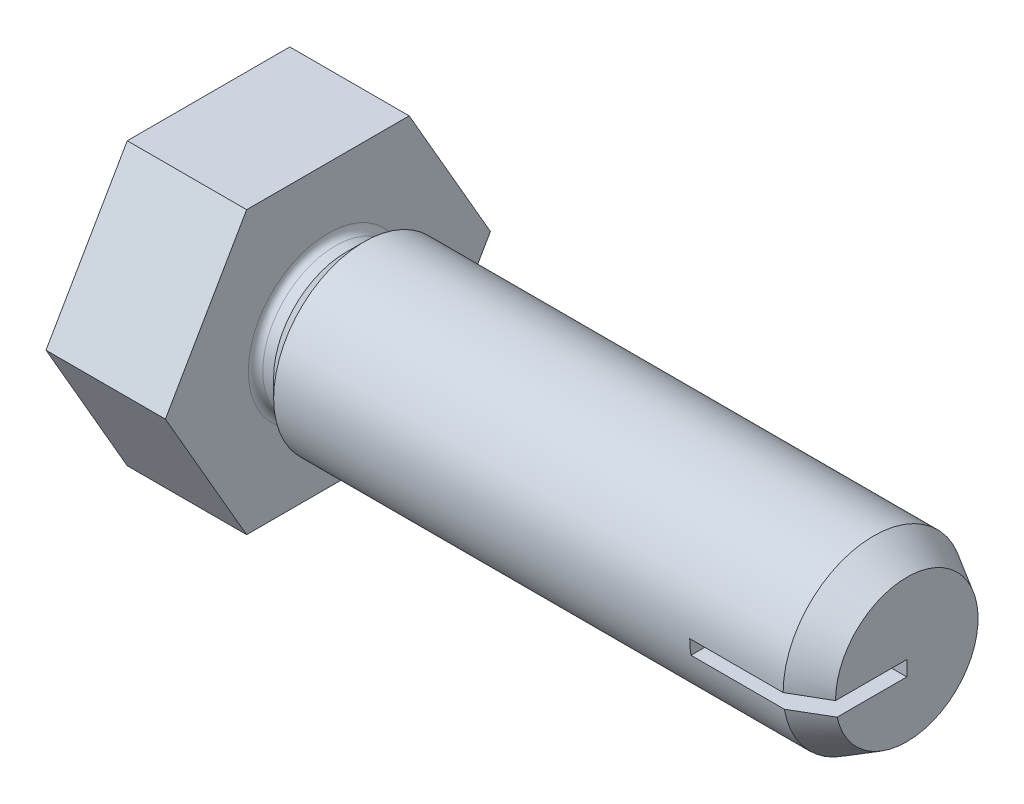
ISO-10303-21;
HEADER;
FILE_DESCRIPTION(('STEP AP214'),'2;1');
FILE_NAME('part.step','',(''),(''),'','','');
FILE_SCHEMA(('AUTOMOTIVE_DESIGN { 1 0 10303 214 1 1 1 1 }'));
ENDSEC;
DATA;
#1=APPLICATION_CONTEXT('core data for automotive mechanical design processes');
#2=APPLICATION_PROTOCOL_DEFINITION('international standard','automotive_design',2000,#1);
#3=PRODUCT_CONTEXT('',#1,'mechanical');
#4=PRODUCT('Part','Part','',(#3));
#5=PRODUCT_RELATED_PRODUCT_CATEGORY('part','',(#4));
#6=PRODUCT_DEFINITION_FORMATION('','',#4);
#7=PRODUCT_DEFINITION_CONTEXT('part definition',#1,'design');
#8=PRODUCT_DEFINITION('design','',#6,#7);
#9=PRODUCT_DEFINITION_SHAPE('','',#8);
#10=(LENGTH_UNIT() NAMED_UNIT(*) SI_UNIT(.MILLI.,.METRE.));
#11=(NAMED_UNIT(*) PLANE_ANGLE_UNIT() SI_UNIT($,.RADIAN.));
#12=(NAMED_UNIT(*) SI_UNIT($,.STERADIAN.) SOLID_ANGLE_UNIT());
#13=UNCERTAINTY_MEASURE_WITH_UNIT(LENGTH_MEASURE(1.E-05),#10,'distance_accuracy_value','');
#14=(GEOMETRIC_REPRESENTATION_CONTEXT(3) GLOBAL_UNCERTAINTY_ASSIGNED_CONTEXT((#13)) GLOBAL_UNIT_ASSIGNED_CONTEXT((#10,
#11,#12)) REPRESENTATION_CONTEXT('',''));
#15=CARTESIAN_POINT('',(0.,0.,0.));
#16=DIRECTION('',(0.,0.,1.));
#17=DIRECTION('',(1.,0.,0.));
#18=AXIS2_PLACEMENT_3D('',#15,#16,#17);
#19=CARTESIAN_POINT('',(0.,0.,0.));
#20=DIRECTION('',(-1.,0.,0.));
#21=DIRECTION('',(0.,0.,1.));
#22=AXIS2_PLACEMENT_3D('',#19,#20,#21);
#23=CYLINDRICAL_SURFACE('',#22,2.5);
#24=CARTESIAN_POINT('',(1.,0.,0.));
#25=DIRECTION('',(-1.,0.,0.));
#26=DIRECTION('',(0.,0.,1.));
#27=AXIS2_PLACEMENT_3D('',#24,#25,#26);
#28=CIRCLE('',#27,2.5);
#29=CARTESIAN_POINT('',(1.,0.,2.5));
#30=VERTEX_POINT('',#29);
#31=EDGE_CURVE('E244',#30,#30,#28,.T.);
#32=ORIENTED_EDGE('',*,*,#31,.F.);
#33=EDGE_LOOP('',(#32));
#34=FACE_BOUND('',#33,.T.);
#35=DIRECTION('',(-1.,0.,0.));
#36=VECTOR('',#35,1.);
#37=CARTESIAN_POINT('',(0.,0.,2.5));
#38=LINE('',#37,#36);
#39=CARTESIAN_POINT('',(15.0820130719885,0.,2.5));
#40=VERTEX_POINT('',#39);
#41=CARTESIAN_POINT('',(12.5,0.,2.5));
#42=VERTEX_POINT('',#41);
#43=EDGE_CURVE('E278',#40,#42,#38,.T.);
#44=ORIENTED_EDGE('',*,*,#43,.F.);
#45=CARTESIAN_POINT('',(15.0820130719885,0.,0.));
#46=DIRECTION('',(-1.,0.,0.));
#47=DIRECTION('',(0.,0.,1.));
#48=AXIS2_PLACEMENT_3D('',#45,#46,#47);
#49=CIRCLE('',#48,2.5);
#50=CARTESIAN_POINT('',(15.0820130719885,-0.416666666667,2.46503324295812));
#51=VERTEX_POINT('',#50);
#52=EDGE_CURVE('E280',#40,#51,#49,.T.);
#53=ORIENTED_EDGE('',*,*,#52,.T.);
#54=DIRECTION('',(-1.,0.,0.));
#55=VECTOR('',#54,1.);
#56=CARTESIAN_POINT('',(0.,-0.416666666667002,2.46503324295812));
#57=LINE('',#56,#55);
#58=CARTESIAN_POINT('',(12.5,-0.416666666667,2.46503324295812));
#59=VERTEX_POINT('',#58);
#60=EDGE_CURVE('E279',#59,#51,#57,.F.);
#61=ORIENTED_EDGE('',*,*,#60,.F.);
#62=CARTESIAN_POINT('',(12.5,0.,0.));
#63=DIRECTION('',(1.,0.,0.));
#64=DIRECTION('',(0.,0.,-1.));
#65=AXIS2_PLACEMENT_3D('',#62,#63,#64);
#66=CIRCLE('',#65,2.5);
#67=EDGE_CURVE('E107',#42,#59,#66,.T.);
#68=ORIENTED_EDGE('',*,*,#67,.F.);
#69=EDGE_LOOP('',(#44,#53,#61,#68));
#70=FACE_BOUND('',#69,.T.);
#71=ADVANCED_FACE('F138',(#34,#70),#23,.T.);
#72=CARTESIAN_POINT('',(15.0820130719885,0.,0.));
#73=DIRECTION('',(-1.,0.,0.));
#74=DIRECTION('',(0.,0.,1.));
#75=AXIS2_PLACEMENT_3D('',#72,#73,#74);
#76=CONICAL_SURFACE('',#75,2.5,0.523598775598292);
#77=ORIENTED_EDGE('',*,*,#52,.F.);
#78=DIRECTION('',(-0.866025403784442,0.,0.499999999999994));
#79=VECTOR('',#78,1.);
#80=CARTESIAN_POINT('',(19.4121400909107,0.,0.));
#81=LINE('',#80,#79);
#82=CARTESIAN_POINT('',(16.,0.,1.97));
#83=VERTEX_POINT('',#82);
#84=EDGE_CURVE('E258',#40,#83,#81,.F.);
#85=ORIENTED_EDGE('',*,*,#84,.T.);
#86=CARTESIAN_POINT('',(16.,0.,0.));
#87=DIRECTION('',(-1.,0.,0.));
#88=DIRECTION('',(0.,0.,1.));
#89=AXIS2_PLACEMENT_3D('',#86,#87,#88);
#90=CIRCLE('',#89,1.97);
#91=CARTESIAN_POINT('',(16.,-0.416666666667,1.92543213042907));
#92=VERTEX_POINT('',#91);
#93=EDGE_CURVE('E273',#83,#92,#90,.T.);
#94=ORIENTED_EDGE('',*,*,#93,.T.);
#95=CARTESIAN_POINT('',(18.08614728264,-0.416666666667,0.64224180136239));
#96=CARTESIAN_POINT('',(18.0510723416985,-0.416666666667,0.666370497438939));
#97=CARTESIAN_POINT('',(18.015820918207,-0.416666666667,0.690239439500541));
#98=CARTESIAN_POINT('',(17.9450410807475,-0.416666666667,0.737559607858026));
#99=CARTESIAN_POINT('',(17.9095126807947,-0.416666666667,0.761010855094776));
#100=CARTESIAN_POINT('',(17.8026301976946,-0.416666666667,0.830888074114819));
#101=CARTESIAN_POINT('',(17.730969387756,-0.416666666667,0.876843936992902));
#102=CARTESIAN_POINT('',(17.5871601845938,-0.416666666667,0.967946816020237));
#103=CARTESIAN_POINT('',(17.5150119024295,-0.416666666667,1.01309400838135));
#104=CARTESIAN_POINT('',(17.3703728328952,-0.416666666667,1.10284266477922));
#105=CARTESIAN_POINT('',(17.2978820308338,-0.416666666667,1.14744410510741));
#106=CARTESIAN_POINT('',(17.0861944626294,-0.416666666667,1.27692130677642));
#107=CARTESIAN_POINT('',(16.946685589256,-0.416666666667,1.36128610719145));
#108=CARTESIAN_POINT('',(16.667187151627,-0.416666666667,1.52921629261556));
#109=CARTESIAN_POINT('',(16.5271975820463,-0.416666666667,1.61278166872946));
#110=CARTESIAN_POINT('',(16.1067337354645,-0.416666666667,1.8627701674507));
#111=CARTESIAN_POINT('',(15.8258193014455,-0.416666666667,2.02845244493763));
#112=CARTESIAN_POINT('',(15.3306932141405,-0.416666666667,2.31940386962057));
#113=CARTESIAN_POINT('',(15.1165930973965,-0.416666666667,2.44486357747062));
#114=CARTESIAN_POINT('',(14.6881891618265,-0.416666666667,2.6954350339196));
#115=CARTESIAN_POINT('',(14.4738853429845,-0.416666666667,2.82054678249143));
#116=CARTESIAN_POINT('',(14.0452309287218,-0.416666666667,3.07049358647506));
#117=CARTESIAN_POINT('',(13.8308803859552,-0.416666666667,3.19532873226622));
#118=CARTESIAN_POINT('',(13.4020836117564,-0.416666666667,3.44483385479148));
#119=CARTESIAN_POINT('',(13.1876373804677,-0.416666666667,3.56950383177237));
#120=CARTESIAN_POINT('',(12.9731611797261,-0.416666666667,3.69412218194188));
#121=B_SPLINE_CURVE_WITH_KNOTS('',3,(#95,#96,#97,#98,#99,#100,#101,#102,#103,#104,#105,#106,
#107,#108,#109,#110,#111,#112,#113,#114,#115,#116,#117,#118,#119,#120),.UNSPECIFIED.,.F.,.F.,(4,
2,2,2,2,2,2,2,2,2,2,2,4),(0.,0.127714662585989,0.255422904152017,0.510805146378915,
0.766131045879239,1.02146799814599,1.51056493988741,1.99966731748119,2.97806477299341,
3.7225183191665,4.46697192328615,5.21112892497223,5.95528481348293),.UNSPECIFIED.);
#122=EDGE_CURVE('E473',#92,#51,#121,.T.);
#123=ORIENTED_EDGE('',*,*,#122,.T.);
#124=EDGE_LOOP('',(#77,#85,#94,#123));
#125=FACE_BOUND('',#124,.T.);
#126=ADVANCED_FACE('F275',(#125),#76,.T.);
#127=CARTESIAN_POINT('',(16.,2.5,0.));
#128=DIRECTION('',(-1.,0.,0.));
#129=DIRECTION('',(0.,0.,1.));
#130=AXIS2_PLACEMENT_3D('',#127,#128,#129);
#131=PLANE('',#130);
#132=DIRECTION('',(0.,0.,1.));
#133=VECTOR('',#132,1.);
#134=CARTESIAN_POINT('',(16.,0.,0.));
#135=LINE('',#134,#133);
#136=CARTESIAN_POINT('',(16.,0.,0.));
#137=VERTEX_POINT('',#136);
#138=EDGE_CURVE('E144',#137,#83,#135,.T.);
#139=ORIENTED_EDGE('',*,*,#138,.F.);
#140=DIRECTION('',(0.,1.,0.));
#141=VECTOR('',#140,1.);
#142=CARTESIAN_POINT('',(16.,0.,0.));
#143=LINE('',#142,#141);
#144=CARTESIAN_POINT('',(16.,-0.416666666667,0.));
#145=VERTEX_POINT('',#144);
#146=EDGE_CURVE('E510',#145,#137,#143,.T.);
#147=ORIENTED_EDGE('',*,*,#146,.F.);
#148=DIRECTION('',(0.,0.,-1.));
#149=VECTOR('',#148,1.);
#150=CARTESIAN_POINT('',(16.,-0.416666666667,0.));
#151=LINE('',#150,#149);
#152=EDGE_CURVE('E247',#92,#145,#151,.T.);
#153=ORIENTED_EDGE('',*,*,#152,.F.);
#154=ORIENTED_EDGE('',*,*,#93,.F.);
#155=EDGE_LOOP('',(#139,#147,#153,#154));
#156=FACE_BOUND('',#155,.T.);
#157=ADVANCED_FACE('F285',(#156),#131,.F.);
#158=CARTESIAN_POINT('',(1.,0.,0.));
#159=DIRECTION('',(1.,0.,0.));
#160=DIRECTION('',(0.,0.,-1.));
#161=AXIS2_PLACEMENT_3D('',#158,#159,#160);
#162=CONICAL_SURFACE('',#161,2.5,0.78539816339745);
#163=CARTESIAN_POINT('',(0.500000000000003,0.,0.));
#164=DIRECTION('',(-1.,0.,0.));
#165=DIRECTION('',(0.,0.,1.));
#166=AXIS2_PLACEMENT_3D('',#163,#164,#165);
#167=CIRCLE('',#166,2.);
#168=CARTESIAN_POINT('',(0.500000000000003,0.,2.));
#169=VERTEX_POINT('',#168);
#170=EDGE_CURVE('E245',#169,#169,#167,.T.);
#171=ORIENTED_EDGE('',*,*,#170,.F.);
#172=EDGE_LOOP('',(#171));
#173=FACE_BOUND('',#172,.T.);
#174=ORIENTED_EDGE('',*,*,#31,.T.);
#175=EDGE_LOOP('',(#174));
#176=FACE_BOUND('',#175,.T.);
#177=ADVANCED_FACE('F340',(#173,#176),#162,.T.);
#178=CARTESIAN_POINT('',(0.,0.,0.));
#179=DIRECTION('',(-1.,0.,0.));
#180=DIRECTION('',(0.,0.,1.));
#181=AXIS2_PLACEMENT_3D('',#178,#179,#180);
#182=CYLINDRICAL_SURFACE('',#181,2.);
#183=CARTESIAN_POINT('',(0.200000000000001,0.,0.));
#184=DIRECTION('',(-1.,0.,0.));
#185=DIRECTION('',(0.,0.,1.));
#186=AXIS2_PLACEMENT_3D('',#183,#184,#185);
#187=CIRCLE('',#186,2.);
#188=CARTESIAN_POINT('',(0.200000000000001,0.,2.));
#189=VERTEX_POINT('',#188);
#190=EDGE_CURVE('E238',#189,#189,#187,.T.);
#191=ORIENTED_EDGE('',*,*,#190,.F.);
#192=EDGE_LOOP('',(#191));
#193=FACE_BOUND('',#192,.T.);
#194=ORIENTED_EDGE('',*,*,#170,.T.);
#195=EDGE_LOOP('',(#194));
#196=FACE_BOUND('',#195,.T.);
#197=ADVANCED_FACE('F344',(#193,#196),#182,.T.);
#198=CARTESIAN_POINT('',(0.200000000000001,0.,0.));
#199=DIRECTION('',(-1.,0.,0.));
#200=DIRECTION('',(0.,0.,1.));
#201=AXIS2_PLACEMENT_3D('',#198,#199,#200);
#202=TOROIDAL_SURFACE('',#201,2.2,0.2);
#203=CARTESIAN_POINT('',(0.,0.,0.));
#204=DIRECTION('',(-1.,0.,0.));
#205=DIRECTION('',(0.,0.,1.));
#206=AXIS2_PLACEMENT_3D('',#203,#204,#205);
#207=CIRCLE('',#206,2.2);
#208=CARTESIAN_POINT('',(0.,0.,2.2));
#209=VERTEX_POINT('',#208);
#210=EDGE_CURVE('E232',#209,#209,#207,.T.);
#211=ORIENTED_EDGE('',*,*,#210,.F.);
#212=EDGE_LOOP('',(#211));
#213=FACE_BOUND('',#212,.T.);
#214=ORIENTED_EDGE('',*,*,#190,.T.);
#215=EDGE_LOOP('',(#214));
#216=FACE_BOUND('',#215,.T.);
#217=ADVANCED_FACE('F346',(#213,#216),#202,.F.);
#218=CARTESIAN_POINT('',(0.,3.89,0.));
#219=DIRECTION('',(-1.,0.,0.));
#220=DIRECTION('',(0.,0.,1.));
#221=AXIS2_PLACEMENT_3D('',#218,#219,#220);
#222=PLANE('',#221);
#223=DIRECTION('',(0.,0.866025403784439,0.5));
#224=VECTOR('',#223,1.);
#225=CARTESIAN_POINT('',(0.,1.945,-3.36883882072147));
#226=LINE('',#225,#224);
#227=CARTESIAN_POINT('',(0.,0.,-4.49178509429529));
#228=VERTEX_POINT('',#227);
#229=CARTESIAN_POINT('',(0.,3.89,-2.24589254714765));
#230=VERTEX_POINT('',#229);
#231=EDGE_CURVE('E156',#228,#230,#226,.T.);
#232=ORIENTED_EDGE('',*,*,#231,.T.);
#233=DIRECTION('',(0.,0.,1.));
#234=VECTOR('',#233,1.);
#235=CARTESIAN_POINT('',(0.,3.89,0.));
#236=LINE('',#235,#234);
#237=CARTESIAN_POINT('',(0.,3.89,2.24589254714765));
#238=VERTEX_POINT('',#237);
#239=EDGE_CURVE('E295',#230,#238,#236,.T.);
#240=ORIENTED_EDGE('',*,*,#239,.T.);
#241=DIRECTION('',(0.,-0.866025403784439,0.5));
#242=VECTOR('',#241,1.);
#243=CARTESIAN_POINT('',(0.,0.,4.49178509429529));
#244=LINE('',#243,#242);
#245=CARTESIAN_POINT('',(0.,0.,4.49178509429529));
#246=VERTEX_POINT('',#245);
#247=EDGE_CURVE('E211',#238,#246,#244,.T.);
#248=ORIENTED_EDGE('',*,*,#247,.T.);
#249=DIRECTION('',(0.,-0.866025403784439,-0.5));
#250=VECTOR('',#249,1.);
#251=CARTESIAN_POINT('',(0.,-3.89,2.24589254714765));
#252=LINE('',#251,#250);
#253=CARTESIAN_POINT('',(0.,-3.89,2.24589254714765));
#254=VERTEX_POINT('',#253);
#255=EDGE_CURVE('E209',#246,#254,#252,.T.);
#256=ORIENTED_EDGE('',*,*,#255,.T.);
#257=DIRECTION('',(0.,0.,-1.));
#258=VECTOR('',#257,1.);
#259=CARTESIAN_POINT('',(0.,-3.89,-2.24589254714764));
#260=LINE('',#259,#258);
#261=CARTESIAN_POINT('',(0.,-3.89,-2.24589254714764));
#262=VERTEX_POINT('',#261);
#263=EDGE_CURVE('E196',#254,#262,#260,.T.);
#264=ORIENTED_EDGE('',*,*,#263,.T.);
#265=DIRECTION('',(0.,0.866025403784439,-0.5));
#266=VECTOR('',#265,1.);
#267=CARTESIAN_POINT('',(0.,-1.945,-3.36883882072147));
#268=LINE('',#267,#266);
#269=EDGE_CURVE('E237',#262,#228,#268,.T.);
#270=ORIENTED_EDGE('',*,*,#269,.T.);
#271=EDGE_LOOP('',(#232,#240,#248,#256,#264,#270));
#272=FACE_BOUND('',#271,.T.);
#273=ORIENTED_EDGE('',*,*,#210,.T.);
#274=EDGE_LOOP('',(#273));
#275=FACE_BOUND('',#274,.T.);
#276=ADVANCED_FACE('F215',(#272,#275),#222,.F.);
#277=CARTESIAN_POINT('',(11.8841463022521,-1.945,-3.36883882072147));
#278=DIRECTION('',(0.,-0.5,-0.866025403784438));
#279=DIRECTION('',(0.,0.866025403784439,-0.5));
#280=AXIS2_PLACEMENT_3D('',#277,#278,#279);
#281=PLANE('',#280);
#282=DIRECTION('',(-1.,0.,0.));
#283=VECTOR('',#282,1.);
#284=CARTESIAN_POINT('',(11.8841463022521,-3.89,-2.24589254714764));
#285=LINE('',#284,#283);
#286=CARTESIAN_POINT('',(-3.3,-3.89,-2.24589254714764));
#287=VERTEX_POINT('',#286);
#288=EDGE_CURVE('E210',#262,#287,#285,.T.);
#289=ORIENTED_EDGE('',*,*,#288,.T.);
#290=DIRECTION('',(0.,-0.866025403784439,0.5));
#291=VECTOR('',#290,1.);
#292=CARTESIAN_POINT('',(-3.3,-1.945,-3.36883882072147));
#293=LINE('',#292,#291);
#294=CARTESIAN_POINT('',(-3.3,0.,-4.49178509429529));
#295=VERTEX_POINT('',#294);
#296=EDGE_CURVE('E291',#295,#287,#293,.T.);
#297=ORIENTED_EDGE('',*,*,#296,.F.);
#298=DIRECTION('',(-1.,0.,0.));
#299=VECTOR('',#298,1.);
#300=CARTESIAN_POINT('',(11.8841463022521,0.,-4.49178509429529));
#301=LINE('',#300,#299);
#302=EDGE_CURVE('E286',#228,#295,#301,.T.);
#303=ORIENTED_EDGE('',*,*,#302,.F.);
#304=ORIENTED_EDGE('',*,*,#269,.F.);
#305=EDGE_LOOP('',(#289,#297,#303,#304));
#306=FACE_BOUND('',#305,.T.);
#307=ADVANCED_FACE('F307',(#306),#281,.T.);
#308=CARTESIAN_POINT('',(11.8841463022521,1.945,-3.36883882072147));
#309=DIRECTION('',(0.,0.5,-0.866025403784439));
#310=DIRECTION('',(0.,0.866025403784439,0.5));
#311=AXIS2_PLACEMENT_3D('',#308,#309,#310);
#312=PLANE('',#311);
#313=ORIENTED_EDGE('',*,*,#302,.T.);
#314=DIRECTION('',(0.,-0.866025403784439,-0.5));
#315=VECTOR('',#314,1.);
#316=CARTESIAN_POINT('',(-3.3,1.945,-3.36883882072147));
#317=LINE('',#316,#315);
#318=CARTESIAN_POINT('',(-3.3,3.89,-2.24589254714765));
#319=VERTEX_POINT('',#318);
#320=EDGE_CURVE('E293',#319,#295,#317,.T.);
#321=ORIENTED_EDGE('',*,*,#320,.F.);
#322=DIRECTION('',(-1.,0.,0.));
#323=VECTOR('',#322,1.);
#324=CARTESIAN_POINT('',(11.8841463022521,3.89,-2.24589254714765));
#325=LINE('',#324,#323);
#326=EDGE_CURVE('E299',#230,#319,#325,.T.);
#327=ORIENTED_EDGE('',*,*,#326,.F.);
#328=ORIENTED_EDGE('',*,*,#231,.F.);
#329=EDGE_LOOP('',(#313,#321,#327,#328));
#330=FACE_BOUND('',#329,.T.);
#331=ADVANCED_FACE('F311',(#330),#312,.T.);
#332=CARTESIAN_POINT('',(11.8841463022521,3.89,0.));
#333=DIRECTION('',(0.,1.,0.));
#334=DIRECTION('',(0.,0.,1.));
#335=AXIS2_PLACEMENT_3D('',#332,#333,#334);
#336=PLANE('',#335);
#337=ORIENTED_EDGE('',*,*,#326,.T.);
#338=DIRECTION('',(0.,0.,-1.));
#339=VECTOR('',#338,1.);
#340=CARTESIAN_POINT('',(-3.3,3.89,0.));
#341=LINE('',#340,#339);
#342=CARTESIAN_POINT('',(-3.3,3.89,2.24589254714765));
#343=VERTEX_POINT('',#342);
#344=EDGE_CURVE('E234',#343,#319,#341,.T.);
#345=ORIENTED_EDGE('',*,*,#344,.F.);
#346=DIRECTION('',(-1.,0.,0.));
#347=VECTOR('',#346,1.);
#348=CARTESIAN_POINT('',(11.8841463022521,3.89,2.24589254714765));
#349=LINE('',#348,#347);
#350=EDGE_CURVE('E222',#238,#343,#349,.T.);
#351=ORIENTED_EDGE('',*,*,#350,.F.);
#352=ORIENTED_EDGE('',*,*,#239,.F.);
#353=EDGE_LOOP('',(#337,#345,#351,#352));
#354=FACE_BOUND('',#353,.T.);
#355=ADVANCED_FACE('F312',(#354),#336,.T.);
#356=CARTESIAN_POINT('',(11.8841463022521,-3.89,-2.24589254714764));
#357=DIRECTION('',(0.,-1.,0.));
#358=DIRECTION('',(0.,0.,-1.));
#359=AXIS2_PLACEMENT_3D('',#356,#357,#358);
#360=PLANE('',#359);
#361=DIRECTION('',(-1.,0.,0.));
#362=VECTOR('',#361,1.);
#363=CARTESIAN_POINT('',(11.8841463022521,-3.89,2.24589254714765));
#364=LINE('',#363,#362);
#365=CARTESIAN_POINT('',(-3.3,-3.89,2.24589254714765));
#366=VERTEX_POINT('',#365);
#367=EDGE_CURVE('E205',#254,#366,#364,.T.);
#368=ORIENTED_EDGE('',*,*,#367,.T.);
#369=DIRECTION('',(0.,0.,1.));
#370=VECTOR('',#369,1.);
#371=CARTESIAN_POINT('',(-3.3,-3.89,-2.24589254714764));
#372=LINE('',#371,#370);
#373=EDGE_CURVE('E228',#287,#366,#372,.T.);
#374=ORIENTED_EDGE('',*,*,#373,.F.);
#375=ORIENTED_EDGE('',*,*,#288,.F.);
#376=ORIENTED_EDGE('',*,*,#263,.F.);
#377=EDGE_LOOP('',(#368,#374,#375,#376));
#378=FACE_BOUND('',#377,.T.);
#379=ADVANCED_FACE('F203',(#378),#360,.T.);
#380=CARTESIAN_POINT('',(11.8841463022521,-3.89,2.24589254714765));
#381=DIRECTION('',(0.,-0.5,0.866025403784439));
#382=DIRECTION('',(0.,-0.866025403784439,-0.5));
#383=AXIS2_PLACEMENT_3D('',#380,#381,#382);
#384=PLANE('',#383);
#385=DIRECTION('',(-1.,0.,0.));
#386=VECTOR('',#385,1.);
#387=CARTESIAN_POINT('',(11.8841463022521,0.,4.49178509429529));
#388=LINE('',#387,#386);
#389=CARTESIAN_POINT('',(-3.3,0.,4.49178509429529));
#390=VERTEX_POINT('',#389);
#391=EDGE_CURVE('E233',#246,#390,#388,.T.);
#392=ORIENTED_EDGE('',*,*,#391,.T.);
#393=DIRECTION('',(0.,0.866025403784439,0.5));
#394=VECTOR('',#393,1.);
#395=CARTESIAN_POINT('',(-3.3,-3.89,2.24589254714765));
#396=LINE('',#395,#394);
#397=EDGE_CURVE('E223',#366,#390,#396,.T.);
#398=ORIENTED_EDGE('',*,*,#397,.F.);
#399=ORIENTED_EDGE('',*,*,#367,.F.);
#400=ORIENTED_EDGE('',*,*,#255,.F.);
#401=EDGE_LOOP('',(#392,#398,#399,#400));
#402=FACE_BOUND('',#401,.T.);
#403=ADVANCED_FACE('F218',(#402),#384,.T.);
#404=CARTESIAN_POINT('',(11.8841463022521,0.,4.49178509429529));
#405=DIRECTION('',(0.,0.5,0.866025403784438));
#406=DIRECTION('',(0.,-0.866025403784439,0.5));
#407=AXIS2_PLACEMENT_3D('',#404,#405,#406);
#408=PLANE('',#407);
#409=DIRECTION('',(0.,0.866025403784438,-0.5));
#410=VECTOR('',#409,1.);
#411=CARTESIAN_POINT('',(-3.3,0.,4.49178509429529));
#412=LINE('',#411,#410);
#413=EDGE_CURVE('E281',#390,#343,#412,.T.);
#414=ORIENTED_EDGE('',*,*,#413,.F.);
#415=ORIENTED_EDGE('',*,*,#391,.F.);
#416=ORIENTED_EDGE('',*,*,#247,.F.);
#417=ORIENTED_EDGE('',*,*,#350,.T.);
#418=EDGE_LOOP('',(#414,#415,#416,#417));
#419=FACE_BOUND('',#418,.T.);
#420=ADVANCED_FACE('F314',(#419),#408,.T.);
#421=CARTESIAN_POINT('',(-3.3,3.89,0.));
#422=DIRECTION('',(1.,0.,0.));
#423=DIRECTION('',(0.,0.,-1.));
#424=AXIS2_PLACEMENT_3D('',#421,#422,#423);
#425=PLANE('',#424);
#426=CARTESIAN_POINT('',(-3.3,0.,0.));
#427=DIRECTION('',(-1.,0.,0.));
#428=DIRECTION('',(0.,0.,1.));
#429=AXIS2_PLACEMENT_3D('',#426,#427,#428);
#430=CIRCLE('',#429,3.112);
#431=CARTESIAN_POINT('',(-3.3,0.,3.112));
#432=VERTEX_POINT('',#431);
#433=EDGE_CURVE('E509',#432,#432,#430,.T.);
#434=ORIENTED_EDGE('',*,*,#433,.F.);
#435=EDGE_LOOP('',(#434));
#436=FACE_BOUND('',#435,.T.);
#437=ORIENTED_EDGE('',*,*,#397,.T.);
#438=ORIENTED_EDGE('',*,*,#413,.T.);
#439=ORIENTED_EDGE('',*,*,#344,.T.);
#440=ORIENTED_EDGE('',*,*,#320,.T.);
#441=ORIENTED_EDGE('',*,*,#296,.T.);
#442=ORIENTED_EDGE('',*,*,#373,.T.);
#443=EDGE_LOOP('',(#437,#438,#439,#440,#441,#442));
#444=FACE_BOUND('',#443,.T.);
#445=ADVANCED_FACE('F137',(#436,#444),#425,.F.);
#446=CARTESIAN_POINT('',(12.5,0.,4.49178509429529));
#447=DIRECTION('',(1.,0.,0.));
#448=DIRECTION('',(0.,0.,-1.));
#449=AXIS2_PLACEMENT_3D('',#446,#447,#448);
#450=PLANE('',#449);
#451=ORIENTED_EDGE('',*,*,#67,.T.);
#452=DIRECTION('',(0.,0.,-1.));
#453=VECTOR('',#452,1.);
#454=CARTESIAN_POINT('',(12.5,-0.416666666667,4.49178509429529));
#455=LINE('',#454,#453);
#456=CARTESIAN_POINT('',(12.5,-0.416666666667,0.));
#457=VERTEX_POINT('',#456);
#458=EDGE_CURVE('E491',#59,#457,#455,.T.);
#459=ORIENTED_EDGE('',*,*,#458,.T.);
#460=DIRECTION('',(0.,-1.,0.));
#461=VECTOR('',#460,1.);
#462=CARTESIAN_POINT('',(12.5,0.,0.));
#463=LINE('',#462,#461);
#464=CARTESIAN_POINT('',(12.5,0.,0.));
#465=VERTEX_POINT('',#464);
#466=EDGE_CURVE('E495',#465,#457,#463,.T.);
#467=ORIENTED_EDGE('',*,*,#466,.F.);
#468=DIRECTION('',(0.,0.,-1.));
#469=VECTOR('',#468,1.);
#470=CARTESIAN_POINT('',(12.5,0.,4.49178509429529));
#471=LINE('',#470,#469);
#472=EDGE_CURVE('E478',#42,#465,#471,.T.);
#473=ORIENTED_EDGE('',*,*,#472,.F.);
#474=EDGE_LOOP('',(#451,#459,#467,#473));
#475=FACE_BOUND('',#474,.T.);
#476=ADVANCED_FACE('F323',(#475),#450,.T.);
#477=CARTESIAN_POINT('',(16.,0.,4.49178509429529));
#478=DIRECTION('',(0.,-1.,0.));
#479=DIRECTION('',(1.,0.,0.));
#480=AXIS2_PLACEMENT_3D('',#477,#478,#479);
#481=PLANE('',#480);
#482=ORIENTED_EDGE('',*,*,#43,.T.);
#483=ORIENTED_EDGE('',*,*,#472,.T.);
#484=DIRECTION('',(-1.,0.,0.));
#485=VECTOR('',#484,1.);
#486=CARTESIAN_POINT('',(16.,0.,0.));
#487=LINE('',#486,#485);
#488=EDGE_CURVE('E264',#137,#465,#487,.T.);
#489=ORIENTED_EDGE('',*,*,#488,.F.);
#490=ORIENTED_EDGE('',*,*,#138,.T.);
#491=ORIENTED_EDGE('',*,*,#84,.F.);
#492=EDGE_LOOP('',(#482,#483,#489,#490,#491));
#493=FACE_BOUND('',#492,.T.);
#494=ADVANCED_FACE('F260',(#493),#481,.T.);
#495=CARTESIAN_POINT('',(16.,-0.416666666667,4.49178509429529));
#496=DIRECTION('',(0.,1.,0.));
#497=DIRECTION('',(-1.,0.,0.));
#498=AXIS2_PLACEMENT_3D('',#495,#496,#497);
#499=PLANE('',#498);
#500=ORIENTED_EDGE('',*,*,#60,.T.);
#501=ORIENTED_EDGE('',*,*,#122,.F.);
#502=ORIENTED_EDGE('',*,*,#152,.T.);
#503=DIRECTION('',(1.,0.,0.));
#504=VECTOR('',#503,1.);
#505=CARTESIAN_POINT('',(16.,-0.416666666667,0.));
#506=LINE('',#505,#504);
#507=EDGE_CURVE('E152',#457,#145,#506,.T.);
#508=ORIENTED_EDGE('',*,*,#507,.F.);
#509=ORIENTED_EDGE('',*,*,#458,.F.);
#510=EDGE_LOOP('',(#500,#501,#502,#508,#509));
#511=FACE_BOUND('',#510,.T.);
#512=ADVANCED_FACE('F435',(#511),#499,.T.);
#513=CARTESIAN_POINT('',(16.,-0.416666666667,0.));
#514=DIRECTION('',(0.,0.,-1.));
#515=DIRECTION('',(-1.,0.,0.));
#516=AXIS2_PLACEMENT_3D('',#513,#514,#515);
#517=PLANE('',#516);
#518=ORIENTED_EDGE('',*,*,#146,.T.);
#519=ORIENTED_EDGE('',*,*,#488,.T.);
#520=ORIENTED_EDGE('',*,*,#466,.T.);
#521=ORIENTED_EDGE('',*,*,#507,.T.);
#522=EDGE_LOOP('',(#518,#519,#520,#521));
#523=FACE_BOUND('',#522,.T.);
#524=ADVANCED_FACE('F439',(#523),#517,.F.);
#525=CARTESIAN_POINT('',(-2.64,0.,0.));
#526=DIRECTION('',(-1.,0.,0.));
#527=DIRECTION('',(0.,0.,1.));
#528=AXIS2_PLACEMENT_3D('',#525,#526,#527);
#529=CYLINDRICAL_SURFACE('',#528,3.112);
#530=CARTESIAN_POINT('',(-2.64,0.,0.));
#531=DIRECTION('',(-1.,0.,0.));
#532=DIRECTION('',(0.,0.,1.));
#533=AXIS2_PLACEMENT_3D('',#530,#531,#532);
#534=CIRCLE('',#533,3.112);
#535=CARTESIAN_POINT('',(-2.64,0.,3.112));
#536=VERTEX_POINT('',#535);
#537=EDGE_CURVE('E508',#536,#536,#534,.T.);
#538=ORIENTED_EDGE('',*,*,#537,.F.);
#539=EDGE_LOOP('',(#538));
#540=FACE_BOUND('',#539,.T.);
#541=ORIENTED_EDGE('',*,*,#433,.T.);
#542=EDGE_LOOP('',(#541));
#543=FACE_BOUND('',#542,.T.);
#544=ADVANCED_FACE('F446',(#540,#543),#529,.F.);
#545=CARTESIAN_POINT('',(-2.64,0.,0.));
#546=DIRECTION('',(-1.,0.,0.));
#547=DIRECTION('',(0.,0.,1.));
#548=AXIS2_PLACEMENT_3D('',#545,#546,#547);
#549=PLANE('',#548);
#550=ORIENTED_EDGE('',*,*,#537,.T.);
#551=EDGE_LOOP('',(#550));
#552=FACE_BOUND('',#551,.T.);
#553=ADVANCED_FACE('F460',(#552),#549,.T.);
#554=CLOSED_SHELL('',(#71,#126,#157,#177,#197,#217,#276,#307,#331,#355,#379,#403,#420,#445,#476,
#494,#512,#524,#544,#553));
#555=MANIFOLD_SOLID_BREP('B7',#554);
#556=ADVANCED_BREP_SHAPE_REPRESENTATION('',(#18,#555),#14);
#557=SHAPE_DEFINITION_REPRESENTATION(#9,#556);
ENDSEC;
END-ISO-10303-21;
